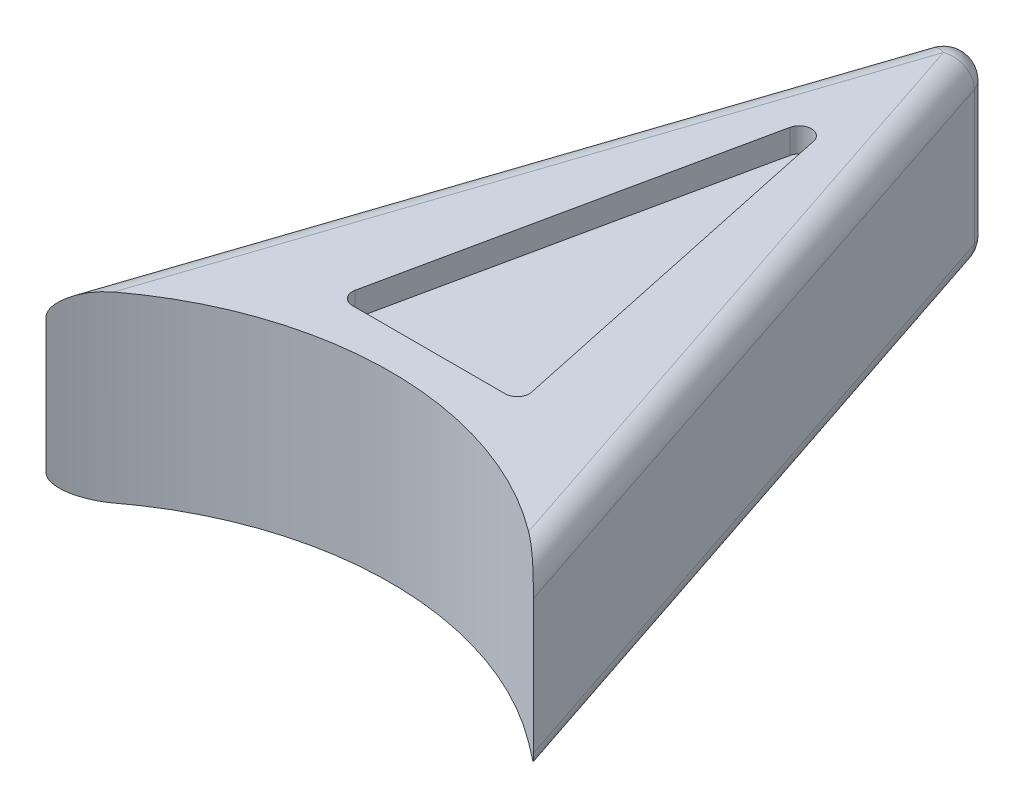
ISO-10303-21;
HEADER;
FILE_DESCRIPTION(('STEP AP214'),'2;1');
FILE_NAME('part.step','',(''),(''),'','','');
FILE_SCHEMA(('AUTOMOTIVE_DESIGN { 1 0 10303 214 1 1 1 1 }'));
ENDSEC;
DATA;
#1=APPLICATION_CONTEXT('core data for automotive mechanical design processes');
#2=APPLICATION_PROTOCOL_DEFINITION('international standard','automotive_design',2000,#1);
#3=PRODUCT_CONTEXT('',#1,'mechanical');
#4=PRODUCT('Part','Part','',(#3));
#5=PRODUCT_RELATED_PRODUCT_CATEGORY('part','',(#4));
#6=PRODUCT_DEFINITION_FORMATION('','',#4);
#7=PRODUCT_DEFINITION_CONTEXT('part definition',#1,'design');
#8=PRODUCT_DEFINITION('design','',#6,#7);
#9=PRODUCT_DEFINITION_SHAPE('','',#8);
#10=(LENGTH_UNIT() NAMED_UNIT(*) SI_UNIT(.MILLI.,.METRE.));
#11=(NAMED_UNIT(*) PLANE_ANGLE_UNIT() SI_UNIT($,.RADIAN.));
#12=(NAMED_UNIT(*) SI_UNIT($,.STERADIAN.) SOLID_ANGLE_UNIT());
#13=UNCERTAINTY_MEASURE_WITH_UNIT(LENGTH_MEASURE(1.E-05),#10,'distance_accuracy_value','');
#14=(GEOMETRIC_REPRESENTATION_CONTEXT(3) GLOBAL_UNCERTAINTY_ASSIGNED_CONTEXT((#13)) GLOBAL_UNIT_ASSIGNED_CONTEXT((#10,
#11,#12)) REPRESENTATION_CONTEXT('',''));
#15=CARTESIAN_POINT('',(0.,0.,0.));
#16=DIRECTION('',(0.,0.,1.));
#17=DIRECTION('',(1.,0.,0.));
#18=AXIS2_PLACEMENT_3D('',#15,#16,#17);
#19=CARTESIAN_POINT('',(25.4,19.05,0.));
#20=DIRECTION('',(-0.948683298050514,0.,0.316227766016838));
#21=DIRECTION('',(0.316227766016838,0.,0.948683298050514));
#22=AXIS2_PLACEMENT_3D('',#19,#20,#21);
#23=PLANE('',#22);
#24=DIRECTION('',(0.,-1.,0.));
#25=VECTOR('',#24,1.);
#26=CARTESIAN_POINT('',(25.4,19.05,0.));
#27=LINE('',#26,#25);
#28=CARTESIAN_POINT('',(25.4,16.51,0.));
#29=VERTEX_POINT('',#28);
#30=CARTESIAN_POINT('',(25.4,2.54000000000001,0.));
#31=VERTEX_POINT('',#30);
#32=EDGE_CURVE('E141',#29,#31,#27,.T.);
#33=ORIENTED_EDGE('',*,*,#32,.T.);
#34=DIRECTION('',(-0.316227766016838,0.,-0.948683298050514));
#35=VECTOR('',#34,1.);
#36=CARTESIAN_POINT('',(2.4096555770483,2.54,-68.9710332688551));
#37=LINE('',#36,#35);
#38=CARTESIAN_POINT('',(2.40965557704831,2.54,-68.9710332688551));
#39=VERTEX_POINT('',#38);
#40=EDGE_CURVE('E137',#31,#39,#37,.T.);
#41=ORIENTED_EDGE('',*,*,#40,.T.);
#42=DIRECTION('',(0.,-1.,0.));
#43=VECTOR('',#42,1.);
#44=CARTESIAN_POINT('',(2.40965557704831,19.05,-68.9710332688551));
#45=LINE('',#44,#43);
#46=CARTESIAN_POINT('',(2.40965557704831,16.51,-68.9710332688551));
#47=VERTEX_POINT('',#46);
#48=EDGE_CURVE('E139',#39,#47,#45,.F.);
#49=ORIENTED_EDGE('',*,*,#48,.T.);
#50=DIRECTION('',(-0.316227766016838,0.,-0.948683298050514));
#51=VECTOR('',#50,1.);
#52=CARTESIAN_POINT('',(25.4,16.51,0.));
#53=LINE('',#52,#51);
#54=EDGE_CURVE('E147',#47,#29,#53,.F.);
#55=ORIENTED_EDGE('',*,*,#54,.T.);
#56=EDGE_LOOP('',(#33,#41,#49,#55));
#57=FACE_BOUND('',#56,.T.);
#58=ADVANCED_FACE('F41',(#57),#23,.F.);
#59=CARTESIAN_POINT('',(0.,19.05,-76.2));
#60=DIRECTION('',(0.948683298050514,0.,0.316227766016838));
#61=DIRECTION('',(0.316227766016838,0.,-0.948683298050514));
#62=AXIS2_PLACEMENT_3D('',#59,#60,#61);
#63=PLANE('',#62);
#64=DIRECTION('',(0.,-1.,0.));
#65=VECTOR('',#64,1.);
#66=CARTESIAN_POINT('',(-2.4096555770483,19.05,-68.9710332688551));
#67=LINE('',#66,#65);
#68=CARTESIAN_POINT('',(-2.4096555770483,16.51,-68.9710332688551));
#69=VERTEX_POINT('',#68);
#70=CARTESIAN_POINT('',(-2.4096555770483,2.54,-68.9710332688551));
#71=VERTEX_POINT('',#70);
#72=EDGE_CURVE('E160',#69,#71,#67,.T.);
#73=ORIENTED_EDGE('',*,*,#72,.T.);
#74=DIRECTION('',(-0.316227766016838,0.,0.948683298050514));
#75=VECTOR('',#74,1.);
#76=CARTESIAN_POINT('',(-25.4,2.54,0.));
#77=LINE('',#76,#75);
#78=CARTESIAN_POINT('',(-25.4,2.54000000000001,0.));
#79=VERTEX_POINT('',#78);
#80=EDGE_CURVE('E245',#71,#79,#77,.T.);
#81=ORIENTED_EDGE('',*,*,#80,.T.);
#82=DIRECTION('',(0.,-1.,0.));
#83=VECTOR('',#82,1.);
#84=CARTESIAN_POINT('',(-25.4,19.05,0.));
#85=LINE('',#84,#83);
#86=CARTESIAN_POINT('',(-25.4,16.51,0.));
#87=VERTEX_POINT('',#86);
#88=EDGE_CURVE('E254',#87,#79,#85,.T.);
#89=ORIENTED_EDGE('',*,*,#88,.F.);
#90=DIRECTION('',(-0.316227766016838,0.,0.948683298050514));
#91=VECTOR('',#90,1.);
#92=CARTESIAN_POINT('',(0.,16.51,-76.2));
#93=LINE('',#92,#91);
#94=EDGE_CURVE('E170',#87,#69,#93,.F.);
#95=ORIENTED_EDGE('',*,*,#94,.T.);
#96=EDGE_LOOP('',(#73,#81,#89,#95));
#97=FACE_BOUND('',#96,.T.);
#98=ADVANCED_FACE('F290',(#97),#63,.F.);
#99=CARTESIAN_POINT('',(0.,19.05,25.4));
#100=DIRECTION('',(0.,-1.,0.));
#101=DIRECTION('',(0.,0.,-1.));
#102=AXIS2_PLACEMENT_3D('',#99,#100,#101);
#103=CYLINDRICAL_SURFACE('',#102,35.9210244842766);
#104=ORIENTED_EDGE('',*,*,#88,.T.);
#105=CARTESIAN_POINT('',(-25.4,2.54,0.));
#106=CARTESIAN_POINT('',(-25.4000079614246,2.50475902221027,8.4973830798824E-06));
#107=CARTESIAN_POINT('',(-25.3988395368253,2.46953826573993,-0.00116050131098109));
#108=CARTESIAN_POINT('',(-25.3942278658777,2.39943815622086,-0.00577115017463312));
#109=CARTESIAN_POINT('',(-25.3907874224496,2.3645584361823,-0.00921000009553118));
#110=CARTESIAN_POINT('',(-25.3772849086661,2.26162477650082,-0.0226980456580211));
#111=CARTESIAN_POINT('',(-25.3640373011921,2.19437447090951,-0.0359232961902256));
#112=CARTESIAN_POINT('',(-25.3258234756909,2.04661622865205,-0.0739779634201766));
#113=CARTESIAN_POINT('',(-25.2986982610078,1.96724235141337,-0.100937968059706));
#114=CARTESIAN_POINT('',(-25.235617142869,1.81534425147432,-0.16336430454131));
#115=CARTESIAN_POINT('',(-25.1996156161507,1.74285818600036,-0.198874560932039));
#116=CARTESIAN_POINT('',(-25.1281670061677,1.61712134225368,-0.268994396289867));
#117=CARTESIAN_POINT('',(-25.0937442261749,1.56273397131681,-0.302656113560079));
#118=CARTESIAN_POINT('',(-25.0214980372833,1.45831385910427,-0.372993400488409));
#119=CARTESIAN_POINT('',(-24.9836722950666,1.40828415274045,-0.409671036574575));
#120=CARTESIAN_POINT('',(-24.8661082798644,1.26401416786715,-0.523125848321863));
#121=CARTESIAN_POINT('',(-24.7823458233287,1.17569661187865,-0.603263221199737));
#122=CARTESIAN_POINT('',(-24.6095228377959,1.01368196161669,-0.766874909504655));
#123=CARTESIAN_POINT('',(-24.5206020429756,0.939727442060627,-0.850250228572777));
#124=CARTESIAN_POINT('',(-24.3376174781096,0.802165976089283,-1.01999170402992));
#125=CARTESIAN_POINT('',(-24.2435491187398,0.73856847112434,-1.10636050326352));
#126=CARTESIAN_POINT('',(-24.0511140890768,0.620249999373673,-1.28109578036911));
#127=CARTESIAN_POINT('',(-23.9527339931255,0.565559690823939,-1.36946801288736));
#128=CARTESIAN_POINT('',(-23.7526498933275,0.464387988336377,-1.54716207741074));
#129=CARTESIAN_POINT('',(-23.6509450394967,0.41790871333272,-1.63648414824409));
#130=CARTESIAN_POINT('',(-23.3961234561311,0.312458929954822,-1.8576910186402));
#131=CARTESIAN_POINT('',(-23.2413585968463,0.257919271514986,-1.98980329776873));
#132=CARTESIAN_POINT('',(-22.9268177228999,0.164334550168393,-2.25362951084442));
#133=CARTESIAN_POINT('',(-22.7670394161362,0.125296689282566,-2.38534323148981));
#134=CARTESIAN_POINT('',(-22.4459409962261,0.0630734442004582,-2.64535095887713));
#135=CARTESIAN_POINT('',(-22.2846852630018,0.0396470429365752,-2.77366610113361));
#136=CARTESIAN_POINT('',(-22.0405569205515,0.0159998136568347,-2.96449410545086));
#137=CARTESIAN_POINT('',(-21.9588333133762,0.0100328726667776,-3.02780923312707));
#138=CARTESIAN_POINT('',(-21.7947147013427,0.00203539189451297,-3.1538284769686));
#139=CARTESIAN_POINT('',(-21.712319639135,5.19196648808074E-06,-3.21653253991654));
#140=CARTESIAN_POINT('',(-21.6296425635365,0.,-3.2788870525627));
#141=B_SPLINE_CURVE_WITH_KNOTS('',3,(#105,#106,#107,#108,#109,#110,#111,#112,#113,#114,#115,
#116,#117,#118,#119,#120,#121,#122,#123,#124,#125,#126,#127,#128,#129,#130,#131,#132,#133,#134,
#135,#136,#137,#138,#139,#140),.UNSPECIFIED.,.F.,.F.,(4,2,2,2,2,2,2,2,2,2,2,2,2,2,2,2,2,4),(0.,
0.105647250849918,0.211164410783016,0.419533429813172,0.682411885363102,0.946670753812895,
1.16427414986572,1.38202790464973,1.81793863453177,2.2451176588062,2.67268394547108,
3.1016921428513,3.53081088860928,4.16208860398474,4.79365926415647,5.41523843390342,
5.72582840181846,6.03644518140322),.UNSPECIFIED.);
#142=CARTESIAN_POINT('',(-21.6296425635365,0.,-3.2788870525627));
#143=VERTEX_POINT('',#142);
#144=EDGE_CURVE('E233',#79,#143,#141,.T.);
#145=ORIENTED_EDGE('',*,*,#144,.T.);
#146=CARTESIAN_POINT('',(0.,0.,25.4));
#147=DIRECTION('',(0.,-1.,0.));
#148=DIRECTION('',(0.,0.,-1.));
#149=AXIS2_PLACEMENT_3D('',#146,#147,#148);
#150=CIRCLE('',#149,35.9210244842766);
#151=CARTESIAN_POINT('',(21.6296425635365,0.,-3.2788870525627));
#152=VERTEX_POINT('',#151);
#153=EDGE_CURVE('E180',#143,#152,#150,.T.);
#154=ORIENTED_EDGE('',*,*,#153,.T.);
#155=CARTESIAN_POINT('',(21.6296425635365,0.,-3.2788870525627));
#156=CARTESIAN_POINT('',(21.7154381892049,6.01707838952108E-06,-3.214180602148));
#157=CARTESIAN_POINT('',(21.8009292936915,0.00219177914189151,-3.14909828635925));
#158=CARTESIAN_POINT('',(21.9711862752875,0.0107984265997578,-3.01827745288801));
#159=CARTESIAN_POINT('',(22.0559521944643,0.0172190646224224,-2.95253897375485));
#160=CARTESIAN_POINT('',(22.3091464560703,0.0426615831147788,-2.75435879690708));
#161=CARTESIAN_POINT('',(22.4763249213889,0.0678636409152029,-2.62106278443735));
#162=CARTESIAN_POINT('',(22.8067337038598,0.134359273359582,-2.35280745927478));
#163=CARTESIAN_POINT('',(22.9699533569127,0.175692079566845,-2.21784487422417));
#164=CARTESIAN_POINT('',(23.2910202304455,0.27467017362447,-1.94761994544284));
#165=CARTESIAN_POINT('',(23.4488708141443,0.332305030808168,-1.81235784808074));
#166=CARTESIAN_POINT('',(23.6794982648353,0.431341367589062,-1.61132324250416));
#167=CARTESIAN_POINT('',(23.7547879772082,0.466133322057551,-1.54512837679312));
#168=CARTESIAN_POINT('',(23.9035690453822,0.54021657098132,-1.41322916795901));
#169=CARTESIAN_POINT('',(23.9770605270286,0.579507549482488,-1.34752479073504));
#170=CARTESIAN_POINT('',(24.1220596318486,0.662974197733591,-1.21683260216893));
#171=CARTESIAN_POINT('',(24.1935649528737,0.707155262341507,-1.15184567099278));
#172=CARTESIAN_POINT('',(24.3341390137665,0.800831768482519,-1.02307242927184));
#173=CARTESIAN_POINT('',(24.4032080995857,0.850326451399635,-0.959285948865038));
#174=CARTESIAN_POINT('',(24.5271153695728,0.946506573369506,-0.843980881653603));
#175=CARTESIAN_POINT('',(24.5824051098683,0.992282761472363,-0.792191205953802));
#176=CARTESIAN_POINT('',(24.690498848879,1.08842743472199,-0.690319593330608));
#177=CARTESIAN_POINT('',(24.7433035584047,1.13879459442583,-0.640237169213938));
#178=CARTESIAN_POINT('',(24.8456884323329,1.24456088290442,-0.542566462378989));
#179=CARTESIAN_POINT('',(24.8952776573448,1.29994471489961,-0.494971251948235));
#180=CARTESIAN_POINT('',(24.9904858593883,1.41651545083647,-0.403100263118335));
#181=CARTESIAN_POINT('',(25.0361086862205,1.47769660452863,-0.358821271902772));
#182=CARTESIAN_POINT('',(25.1205324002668,1.60423428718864,-0.276491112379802));
#183=CARTESIAN_POINT('',(25.1595248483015,1.66934847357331,-0.238268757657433));
#184=CARTESIAN_POINT('',(25.2309911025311,1.8062346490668,-0.167940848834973));
#185=CARTESIAN_POINT('',(25.2634682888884,1.87800315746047,-0.135832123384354));
#186=CARTESIAN_POINT('',(25.3155631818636,2.01731556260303,-0.0841796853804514));
#187=CARTESIAN_POINT('',(25.3363583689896,2.08398352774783,-0.0634932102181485));
#188=CARTESIAN_POINT('',(25.3697565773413,2.22122223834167,-0.030218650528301));
#189=CARTESIAN_POINT('',(25.3823832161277,2.29178108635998,-0.0176072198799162));
#190=CARTESIAN_POINT('',(25.3934951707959,2.39252069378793,-0.00650349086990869));
#191=CARTESIAN_POINT('',(25.3959272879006,2.42189414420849,-0.00407219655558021));
#192=CARTESIAN_POINT('',(25.399181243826,2.48083972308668,-0.0008188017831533));
#193=CARTESIAN_POINT('',(25.4000019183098,2.51041197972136,2.13512160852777E-06));
#194=CARTESIAN_POINT('',(25.4,2.54000000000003,-2.19338687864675E-13));
#195=B_SPLINE_CURVE_WITH_KNOTS('',3,(#155,#156,#157,#158,#159,#160,#161,#162,#163,#164,#165,
#166,#167,#168,#169,#170,#171,#172,#173,#174,#175,#176,#177,#178,#179,#180,#181,#182,#183,#184,
#185,#186,#187,#188,#189,#190,#191,#192,#193,#194),.UNSPECIFIED.,.F.,.F.,(4,2,2,2,2,2,2,2,2,2,2,
2,2,2,2,2,2,2,2,4),(0.,0.322328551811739,0.644638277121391,1.2898062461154,1.93655320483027,
2.5828872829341,2.90114953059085,3.21938944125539,3.53798400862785,3.85653315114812,
4.12193016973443,4.38725080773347,4.65178804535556,4.91606558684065,5.17044086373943,
5.42468382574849,5.642376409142,5.85943673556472,5.94808389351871,6.03679507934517),.UNSPECIFIED.);
#196=EDGE_CURVE('E236',#152,#31,#195,.T.);
#197=ORIENTED_EDGE('',*,*,#196,.T.);
#198=ORIENTED_EDGE('',*,*,#32,.F.);
#199=CARTESIAN_POINT('',(25.4,16.51,0.));
#200=CARTESIAN_POINT('',(25.4000079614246,16.5452409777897,8.49738307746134E-06));
#201=CARTESIAN_POINT('',(25.3988395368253,16.5804617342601,-0.00116050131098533));
#202=CARTESIAN_POINT('',(25.3942278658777,16.6505618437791,-0.00577115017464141));
#203=CARTESIAN_POINT('',(25.3907874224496,16.6854415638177,-0.00921000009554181));
#204=CARTESIAN_POINT('',(25.3772849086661,16.7883752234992,-0.0226980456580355));
#205=CARTESIAN_POINT('',(25.3640373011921,16.8556255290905,-0.0359232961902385));
#206=CARTESIAN_POINT('',(25.3258234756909,17.003383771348,-0.0739779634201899));
#207=CARTESIAN_POINT('',(25.2986982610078,17.0827576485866,-0.100937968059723));
#208=CARTESIAN_POINT('',(25.235617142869,17.2346557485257,-0.163364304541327));
#209=CARTESIAN_POINT('',(25.1996156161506,17.3071418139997,-0.198874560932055));
#210=CARTESIAN_POINT('',(25.1281670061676,17.4328786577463,-0.268994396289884));
#211=CARTESIAN_POINT('',(25.0937442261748,17.4872660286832,-0.302656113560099));
#212=CARTESIAN_POINT('',(25.0214980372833,17.5916861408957,-0.372993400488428));
#213=CARTESIAN_POINT('',(24.9836722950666,17.6417158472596,-0.409671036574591));
#214=CARTESIAN_POINT('',(24.8661082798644,17.7859858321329,-0.523125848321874));
#215=CARTESIAN_POINT('',(24.7823458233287,17.8743033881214,-0.603263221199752));
#216=CARTESIAN_POINT('',(24.6095228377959,18.0363180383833,-0.766874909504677));
#217=CARTESIAN_POINT('',(24.5206020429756,18.1102725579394,-0.850250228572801));
#218=CARTESIAN_POINT('',(24.3376174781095,18.2478340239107,-1.01999170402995));
#219=CARTESIAN_POINT('',(24.2435491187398,18.3114315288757,-1.10636050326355));
#220=CARTESIAN_POINT('',(24.0511140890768,18.4297500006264,-1.28109578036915));
#221=CARTESIAN_POINT('',(23.9527339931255,18.4844403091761,-1.36946801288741));
#222=CARTESIAN_POINT('',(23.7526498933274,18.5856120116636,-1.54716207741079));
#223=CARTESIAN_POINT('',(23.6509450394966,18.6320912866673,-1.63648414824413));
#224=CARTESIAN_POINT('',(23.3961234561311,18.7375410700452,-1.85769101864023));
#225=CARTESIAN_POINT('',(23.2413585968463,18.792080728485,-1.98980329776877));
#226=CARTESIAN_POINT('',(22.9268177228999,18.8856654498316,-2.25362951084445));
#227=CARTESIAN_POINT('',(22.7670394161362,18.9247033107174,-2.38534323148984));
#228=CARTESIAN_POINT('',(22.4459409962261,18.9869265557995,-2.64535095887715));
#229=CARTESIAN_POINT('',(22.2846852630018,19.0103529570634,-2.77366610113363));
#230=CARTESIAN_POINT('',(22.0405569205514,19.0340001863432,-2.96449410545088));
#231=CARTESIAN_POINT('',(21.9588333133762,19.0399671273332,-3.02780923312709));
#232=CARTESIAN_POINT('',(21.7947147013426,19.0479646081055,-3.15382847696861));
#233=CARTESIAN_POINT('',(21.7123196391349,19.0499948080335,-3.21653253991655));
#234=CARTESIAN_POINT('',(21.6296425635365,19.05,-3.2788870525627));
#235=B_SPLINE_CURVE_WITH_KNOTS('',3,(#199,#200,#201,#202,#203,#204,#205,#206,#207,#208,#209,
#210,#211,#212,#213,#214,#215,#216,#217,#218,#219,#220,#221,#222,#223,#224,#225,#226,#227,#228,
#229,#230,#231,#232,#233,#234),.UNSPECIFIED.,.F.,.F.,(4,2,2,2,2,2,2,2,2,2,2,2,2,2,2,2,2,4),(0.,
0.105647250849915,0.211164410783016,0.41953342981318,0.682411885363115,0.946670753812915,
1.16427414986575,1.38202790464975,1.8179386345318,2.24511765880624,2.67268394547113,
3.10169214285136,3.53081088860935,4.16208860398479,4.7936592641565,5.41523843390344,
5.72582840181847,6.03644518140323),.UNSPECIFIED.);
#236=CARTESIAN_POINT('',(21.6296425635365,19.05,-3.27888705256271));
#237=VERTEX_POINT('',#236);
#238=EDGE_CURVE('E242',#29,#237,#235,.T.);
#239=ORIENTED_EDGE('',*,*,#238,.T.);
#240=CARTESIAN_POINT('',(0.,19.05,25.4));
#241=DIRECTION('',(0.,-1.,0.));
#242=DIRECTION('',(0.,0.,-1.));
#243=AXIS2_PLACEMENT_3D('',#240,#241,#242);
#244=CIRCLE('',#243,35.9210244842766);
#245=CARTESIAN_POINT('',(-21.6296425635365,19.05,-3.27888705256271));
#246=VERTEX_POINT('',#245);
#247=EDGE_CURVE('E260',#246,#237,#244,.T.);
#248=ORIENTED_EDGE('',*,*,#247,.F.);
#249=CARTESIAN_POINT('',(-21.6296425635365,19.05,-3.2788870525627));
#250=CARTESIAN_POINT('',(-21.7154381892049,19.0499939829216,-3.21418060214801));
#251=CARTESIAN_POINT('',(-21.8009292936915,19.0478082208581,-3.14909828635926));
#252=CARTESIAN_POINT('',(-21.9711862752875,19.0392015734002,-3.01827745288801));
#253=CARTESIAN_POINT('',(-22.0559521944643,19.0327809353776,-2.95253897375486));
#254=CARTESIAN_POINT('',(-22.3091464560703,19.0073384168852,-2.75435879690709));
#255=CARTESIAN_POINT('',(-22.4763249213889,18.9821363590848,-2.62106278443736));
#256=CARTESIAN_POINT('',(-22.8067337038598,18.9156407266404,-2.35280745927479));
#257=CARTESIAN_POINT('',(-22.9699533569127,18.8743079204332,-2.21784487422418));
#258=CARTESIAN_POINT('',(-23.2910202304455,18.7753298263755,-1.94761994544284));
#259=CARTESIAN_POINT('',(-23.4488708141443,18.7176949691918,-1.81235784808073));
#260=CARTESIAN_POINT('',(-23.6794982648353,18.6186586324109,-1.61132324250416));
#261=CARTESIAN_POINT('',(-23.7547879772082,18.5838666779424,-1.54512837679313));
#262=CARTESIAN_POINT('',(-23.9035690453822,18.5097834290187,-1.41322916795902));
#263=CARTESIAN_POINT('',(-23.9770605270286,18.4704924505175,-1.34752479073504));
#264=CARTESIAN_POINT('',(-24.1220596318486,18.3870258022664,-1.21683260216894));
#265=CARTESIAN_POINT('',(-24.1935649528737,18.3428447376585,-1.15184567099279));
#266=CARTESIAN_POINT('',(-24.3341390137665,18.2491682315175,-1.02307242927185));
#267=CARTESIAN_POINT('',(-24.4032080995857,18.1996735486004,-0.959285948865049));
#268=CARTESIAN_POINT('',(-24.5271153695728,18.1034934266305,-0.843980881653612));
#269=CARTESIAN_POINT('',(-24.5824051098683,18.0577172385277,-0.792191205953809));
#270=CARTESIAN_POINT('',(-24.690498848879,17.961572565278,-0.690319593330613));
#271=CARTESIAN_POINT('',(-24.7433035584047,17.9112054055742,-0.640237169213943));
#272=CARTESIAN_POINT('',(-24.8456884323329,17.8054391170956,-0.542566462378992));
#273=CARTESIAN_POINT('',(-24.8952776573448,17.7500552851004,-0.494971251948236));
#274=CARTESIAN_POINT('',(-24.9904858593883,17.6334845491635,-0.403100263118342));
#275=CARTESIAN_POINT('',(-25.0361086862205,17.5723033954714,-0.358821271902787));
#276=CARTESIAN_POINT('',(-25.1205324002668,17.4457657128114,-0.27649111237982));
#277=CARTESIAN_POINT('',(-25.1595248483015,17.3806515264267,-0.238268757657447));
#278=CARTESIAN_POINT('',(-25.2309911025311,17.2437653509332,-0.16794084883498));
#279=CARTESIAN_POINT('',(-25.2634682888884,17.1719968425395,-0.135832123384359));
#280=CARTESIAN_POINT('',(-25.3155631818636,17.032684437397,-0.0841796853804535));
#281=CARTESIAN_POINT('',(-25.3363583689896,16.9660164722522,-0.0634932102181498));
#282=CARTESIAN_POINT('',(-25.3697565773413,16.8287777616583,-0.0302186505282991));
#283=CARTESIAN_POINT('',(-25.3823832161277,16.75821891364,-0.0176072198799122));
#284=CARTESIAN_POINT('',(-25.3934951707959,16.6574793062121,-0.00650349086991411));
#285=CARTESIAN_POINT('',(-25.3959272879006,16.6281058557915,-0.00407219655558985));
#286=CARTESIAN_POINT('',(-25.399181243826,16.5691602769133,-0.000818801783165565));
#287=CARTESIAN_POINT('',(-25.4000019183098,16.5395880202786,2.13512159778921E-06));
#288=CARTESIAN_POINT('',(-25.4,16.51,-2.21374963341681E-13));
#289=B_SPLINE_CURVE_WITH_KNOTS('',3,(#249,#250,#251,#252,#253,#254,#255,#256,#257,#258,#259,
#260,#261,#262,#263,#264,#265,#266,#267,#268,#269,#270,#271,#272,#273,#274,#275,#276,#277,#278,
#279,#280,#281,#282,#283,#284,#285,#286,#287,#288),.UNSPECIFIED.,.F.,.F.,(4,2,2,2,2,2,2,2,2,2,2,
2,2,2,2,2,2,2,2,4),(0.,0.32232855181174,0.644638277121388,1.2898062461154,1.93655320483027,
2.5828872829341,2.90114953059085,3.21938944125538,3.53798400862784,3.85653315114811,
4.12193016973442,4.38725080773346,4.65178804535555,4.91606558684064,5.17044086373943,
5.42468382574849,5.64237640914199,5.85943673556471,5.94808389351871,6.03679507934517),.UNSPECIFIED.);
#290=EDGE_CURVE('E239',#246,#87,#289,.T.);
#291=ORIENTED_EDGE('',*,*,#290,.T.);
#292=EDGE_LOOP('',(#104,#145,#154,#197,#198,#239,#248,#291));
#293=FACE_BOUND('',#292,.T.);
#294=ADVANCED_FACE('F284',(#293),#103,.F.);
#295=CARTESIAN_POINT('',(0.,19.05,25.4));
#296=DIRECTION('',(0.,-1.,0.));
#297=DIRECTION('',(0.,0.,-1.));
#298=AXIS2_PLACEMENT_3D('',#295,#296,#297);
#299=PLANE('',#298);
#300=DIRECTION('',(-0.208333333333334,0.,0.978057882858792));
#301=VECTOR('',#300,1.);
#302=CARTESIAN_POINT('',(0.,19.05,-59.2149399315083));
#303=LINE('',#302,#301);
#304=CARTESIAN_POINT('',(-1.24213351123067,19.05,-53.3835232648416));
#305=VERTEX_POINT('',#304);
#306=CARTESIAN_POINT('',(-9.19812276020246,19.05,-16.0327168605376));
#307=VERTEX_POINT('',#306);
#308=EDGE_CURVE('E394',#305,#307,#303,.T.);
#309=ORIENTED_EDGE('',*,*,#308,.F.);
#310=CARTESIAN_POINT('',(0.,19.05,-53.1189399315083));
#311=DIRECTION('',(0.,-1.,0.));
#312=DIRECTION('',(0.,0.,-1.));
#313=AXIS2_PLACEMENT_3D('',#310,#311,#312);
#314=CIRCLE('',#313,1.27);
#315=CARTESIAN_POINT('',(1.24213351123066,19.05,-53.3835232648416));
#316=VERTEX_POINT('',#315);
#317=EDGE_CURVE('E221',#305,#316,#314,.T.);
#318=ORIENTED_EDGE('',*,*,#317,.T.);
#319=DIRECTION('',(-0.208333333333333,0.,-0.978057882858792));
#320=VECTOR('',#319,1.);
#321=CARTESIAN_POINT('',(9.52499999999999,19.05,-14.4981335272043));
#322=LINE('',#321,#320);
#323=CARTESIAN_POINT('',(9.19812276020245,19.05,-16.0327168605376));
#324=VERTEX_POINT('',#323);
#325=EDGE_CURVE('E397',#324,#316,#322,.T.);
#326=ORIENTED_EDGE('',*,*,#325,.F.);
#327=CARTESIAN_POINT('',(7.95598924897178,19.05,-15.7681335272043));
#328=DIRECTION('',(0.,-1.,0.));
#329=DIRECTION('',(0.,0.,-1.));
#330=AXIS2_PLACEMENT_3D('',#327,#328,#329);
#331=CIRCLE('',#330,1.27);
#332=CARTESIAN_POINT('',(7.95598924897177,19.05,-14.4981335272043));
#333=VERTEX_POINT('',#332);
#334=EDGE_CURVE('E50',#324,#333,#331,.T.);
#335=ORIENTED_EDGE('',*,*,#334,.T.);
#336=DIRECTION('',(1.,0.,0.));
#337=VECTOR('',#336,1.);
#338=CARTESIAN_POINT('',(-9.52500000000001,19.05,-14.4981335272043));
#339=LINE('',#338,#337);
#340=CARTESIAN_POINT('',(-7.9559892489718,19.05,-14.4981335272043));
#341=VERTEX_POINT('',#340);
#342=EDGE_CURVE('E389',#341,#333,#339,.T.);
#343=ORIENTED_EDGE('',*,*,#342,.F.);
#344=CARTESIAN_POINT('',(-7.9559892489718,19.05,-15.7681335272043));
#345=DIRECTION('',(0.,-1.,0.));
#346=DIRECTION('',(0.,0.,-1.));
#347=AXIS2_PLACEMENT_3D('',#344,#345,#346);
#348=CIRCLE('',#347,1.27);
#349=EDGE_CURVE('E11',#341,#307,#348,.T.);
#350=ORIENTED_EDGE('',*,*,#349,.T.);
#351=EDGE_LOOP('',(#309,#318,#326,#335,#343,#350));
#352=FACE_BOUND('',#351,.T.);
#353=DIRECTION('',(-0.316227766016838,0.,-0.948683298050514));
#354=VECTOR('',#353,1.);
#355=CARTESIAN_POINT('',(28.0703444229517,19.05,16.0432185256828));
#356=LINE('',#355,#354);
#357=CARTESIAN_POINT('',(0.,19.05,-68.1678147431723));
#358=VERTEX_POINT('',#357);
#359=EDGE_CURVE('E146',#237,#358,#356,.T.);
#360=ORIENTED_EDGE('',*,*,#359,.T.);
#361=DIRECTION('',(-0.316227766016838,0.,0.948683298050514));
#362=VECTOR('',#361,1.);
#363=CARTESIAN_POINT('',(-28.0703444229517,19.05,16.0432185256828));
#364=LINE('',#363,#362);
#365=EDGE_CURVE('E185',#358,#246,#364,.T.);
#366=ORIENTED_EDGE('',*,*,#365,.T.);
#367=ORIENTED_EDGE('',*,*,#247,.T.);
#368=EDGE_LOOP('',(#360,#366,#367));
#369=FACE_BOUND('',#368,.T.);
#370=ADVANCED_FACE('F289',(#352,#369),#299,.F.);
#371=CARTESIAN_POINT('',(0.,0.,25.4));
#372=DIRECTION('',(0.,-1.,0.));
#373=DIRECTION('',(0.,0.,-1.));
#374=AXIS2_PLACEMENT_3D('',#371,#372,#373);
#375=PLANE('',#374);
#376=ORIENTED_EDGE('',*,*,#153,.F.);
#377=DIRECTION('',(-0.316227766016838,0.,0.948683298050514));
#378=VECTOR('',#377,1.);
#379=CARTESIAN_POINT('',(0.,0.,-68.1678147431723));
#380=LINE('',#379,#378);
#381=CARTESIAN_POINT('',(0.,0.,-68.1678147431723));
#382=VERTEX_POINT('',#381);
#383=EDGE_CURVE('E228',#143,#382,#380,.F.);
#384=ORIENTED_EDGE('',*,*,#383,.T.);
#385=DIRECTION('',(-0.316227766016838,0.,-0.948683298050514));
#386=VECTOR('',#385,1.);
#387=CARTESIAN_POINT('',(22.9903444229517,0.,0.803218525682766));
#388=LINE('',#387,#386);
#389=EDGE_CURVE('E174',#382,#152,#388,.F.);
#390=ORIENTED_EDGE('',*,*,#389,.T.);
#391=EDGE_LOOP('',(#376,#384,#390));
#392=FACE_BOUND('',#391,.T.);
#393=ADVANCED_FACE('F291',(#392),#375,.T.);
#394=CARTESIAN_POINT('',(0.,19.05,-68.1678147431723));
#395=DIRECTION('',(0.,-1.,0.));
#396=DIRECTION('',(0.,0.,-1.));
#397=AXIS2_PLACEMENT_3D('',#394,#395,#396);
#398=CYLINDRICAL_SURFACE('',#397,2.54);
#399=ORIENTED_EDGE('',*,*,#48,.F.);
#400=CARTESIAN_POINT('',(0.,2.54,-68.1678147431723));
#401=DIRECTION('',(0.,-1.,0.));
#402=DIRECTION('',(0.,0.,-1.));
#403=AXIS2_PLACEMENT_3D('',#400,#401,#402);
#404=CIRCLE('',#403,2.54);
#405=EDGE_CURVE('E155',#39,#71,#404,.F.);
#406=ORIENTED_EDGE('',*,*,#405,.T.);
#407=ORIENTED_EDGE('',*,*,#72,.F.);
#408=CARTESIAN_POINT('',(0.,16.51,-68.1678147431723));
#409=DIRECTION('',(0.,-1.,0.));
#410=DIRECTION('',(0.,0.,-1.));
#411=AXIS2_PLACEMENT_3D('',#408,#409,#410);
#412=CIRCLE('',#411,2.54);
#413=EDGE_CURVE('E158',#69,#47,#412,.T.);
#414=ORIENTED_EDGE('',*,*,#413,.T.);
#415=EDGE_LOOP('',(#399,#406,#407,#414));
#416=FACE_BOUND('',#415,.T.);
#417=ADVANCED_FACE('F153',(#416),#398,.T.);
#418=CARTESIAN_POINT('',(2.40965557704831,2.54,-75.3967814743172));
#419=DIRECTION('',(0.316227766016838,0.,-0.948683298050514));
#420=DIRECTION('',(-0.948683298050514,0.,-0.316227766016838));
#421=AXIS2_PLACEMENT_3D('',#418,#419,#420);
#422=CYLINDRICAL_SURFACE('',#421,2.54);
#423=ORIENTED_EDGE('',*,*,#144,.F.);
#424=ORIENTED_EDGE('',*,*,#80,.F.);
#425=CARTESIAN_POINT('',(0.,2.54,-68.1678147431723));
#426=DIRECTION('',(0.316227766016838,0.,-0.948683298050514));
#427=DIRECTION('',(-0.948683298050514,0.,-0.316227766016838));
#428=AXIS2_PLACEMENT_3D('',#425,#426,#427);
#429=CIRCLE('',#428,2.54);
#430=EDGE_CURVE('E167',#382,#71,#429,.T.);
#431=ORIENTED_EDGE('',*,*,#430,.F.);
#432=ORIENTED_EDGE('',*,*,#383,.F.);
#433=EDGE_LOOP('',(#423,#424,#431,#432));
#434=FACE_BOUND('',#433,.T.);
#435=ADVANCED_FACE('F310',(#434),#422,.T.);
#436=CARTESIAN_POINT('',(22.9903444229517,2.54,0.803218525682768));
#437=DIRECTION('',(0.316227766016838,0.,0.948683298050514));
#438=DIRECTION('',(0.948683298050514,0.,-0.316227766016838));
#439=AXIS2_PLACEMENT_3D('',#436,#437,#438);
#440=CYLINDRICAL_SURFACE('',#439,2.54);
#441=ORIENTED_EDGE('',*,*,#196,.F.);
#442=ORIENTED_EDGE('',*,*,#389,.F.);
#443=CARTESIAN_POINT('',(0.,2.54,-68.1678147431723));
#444=DIRECTION('',(-0.316227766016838,0.,-0.948683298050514));
#445=DIRECTION('',(-0.948683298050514,0.,0.316227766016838));
#446=AXIS2_PLACEMENT_3D('',#443,#444,#445);
#447=CIRCLE('',#446,2.54);
#448=EDGE_CURVE('E165',#39,#382,#447,.T.);
#449=ORIENTED_EDGE('',*,*,#448,.F.);
#450=ORIENTED_EDGE('',*,*,#40,.F.);
#451=EDGE_LOOP('',(#441,#442,#449,#450));
#452=FACE_BOUND('',#451,.T.);
#453=ADVANCED_FACE('F173',(#452),#440,.T.);
#454=CARTESIAN_POINT('',(0.,2.54,-68.1678147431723));
#455=DIRECTION('',(0.,-1.,0.));
#456=DIRECTION('',(0.,0.,-1.));
#457=AXIS2_PLACEMENT_3D('',#454,#455,#456);
#458=SPHERICAL_SURFACE('',#457,2.54);
#459=ORIENTED_EDGE('',*,*,#430,.T.);
#460=ORIENTED_EDGE('',*,*,#405,.F.);
#461=ORIENTED_EDGE('',*,*,#448,.T.);
#462=EDGE_LOOP('',(#459,#460,#461));
#463=FACE_BOUND('',#462,.T.);
#464=ADVANCED_FACE('F164',(#463),#458,.T.);
#465=CARTESIAN_POINT('',(28.0703444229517,16.51,16.0432185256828));
#466=DIRECTION('',(-0.316227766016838,0.,-0.948683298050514));
#467=DIRECTION('',(-0.948683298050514,0.,0.316227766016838));
#468=AXIS2_PLACEMENT_3D('',#465,#466,#467);
#469=CYLINDRICAL_SURFACE('',#468,2.54);
#470=ORIENTED_EDGE('',*,*,#238,.F.);
#471=ORIENTED_EDGE('',*,*,#54,.F.);
#472=CARTESIAN_POINT('',(0.,16.51,-68.1678147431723));
#473=DIRECTION('',(-0.316227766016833,0.,-0.948683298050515));
#474=DIRECTION('',(-0.948683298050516,0.,0.316227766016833));
#475=AXIS2_PLACEMENT_3D('',#472,#473,#474);
#476=CIRCLE('',#475,2.54);
#477=EDGE_CURVE('E176',#358,#47,#476,.T.);
#478=ORIENTED_EDGE('',*,*,#477,.F.);
#479=ORIENTED_EDGE('',*,*,#359,.F.);
#480=EDGE_LOOP('',(#470,#471,#478,#479));
#481=FACE_BOUND('',#480,.T.);
#482=ADVANCED_FACE('F281',(#481),#469,.T.);
#483=CARTESIAN_POINT('',(-28.0703444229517,16.51,16.0432185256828));
#484=DIRECTION('',(-0.316227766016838,0.,0.948683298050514));
#485=DIRECTION('',(0.948683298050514,0.,0.316227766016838));
#486=AXIS2_PLACEMENT_3D('',#483,#484,#485);
#487=CYLINDRICAL_SURFACE('',#486,2.54);
#488=ORIENTED_EDGE('',*,*,#290,.F.);
#489=ORIENTED_EDGE('',*,*,#365,.F.);
#490=CARTESIAN_POINT('',(0.,16.51,-68.1678147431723));
#491=DIRECTION('',(0.316227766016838,0.,-0.948683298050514));
#492=DIRECTION('',(-0.948683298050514,0.,-0.316227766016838));
#493=AXIS2_PLACEMENT_3D('',#490,#491,#492);
#494=CIRCLE('',#493,2.54);
#495=EDGE_CURVE('E182',#69,#358,#494,.T.);
#496=ORIENTED_EDGE('',*,*,#495,.F.);
#497=ORIENTED_EDGE('',*,*,#94,.F.);
#498=EDGE_LOOP('',(#488,#489,#496,#497));
#499=FACE_BOUND('',#498,.T.);
#500=ADVANCED_FACE('F319',(#499),#487,.T.);
#501=CARTESIAN_POINT('',(0.,16.51,-68.1678147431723));
#502=DIRECTION('',(0.,-1.,0.));
#503=DIRECTION('',(0.,0.,-1.));
#504=AXIS2_PLACEMENT_3D('',#501,#502,#503);
#505=SPHERICAL_SURFACE('',#504,2.54);
#506=ORIENTED_EDGE('',*,*,#477,.T.);
#507=ORIENTED_EDGE('',*,*,#413,.F.);
#508=ORIENTED_EDGE('',*,*,#495,.T.);
#509=EDGE_LOOP('',(#506,#507,#508));
#510=FACE_BOUND('',#509,.T.);
#511=ADVANCED_FACE('F316',(#510),#505,.T.);
#512=CARTESIAN_POINT('',(9.52499999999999,16.51,-14.4981335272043));
#513=DIRECTION('',(0.978057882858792,0.,-0.208333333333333));
#514=DIRECTION('',(-0.208333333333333,0.,-0.978057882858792));
#515=AXIS2_PLACEMENT_3D('',#512,#513,#514);
#516=PLANE('',#515);
#517=ORIENTED_EDGE('',*,*,#325,.T.);
#518=DIRECTION('',(0.,1.,0.));
#519=VECTOR('',#518,1.);
#520=CARTESIAN_POINT('',(1.24213351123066,16.51,-53.3835232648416));
#521=LINE('',#520,#519);
#522=CARTESIAN_POINT('',(1.24213351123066,16.51,-53.3835232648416));
#523=VERTEX_POINT('',#522);
#524=EDGE_CURVE('E203',#316,#523,#521,.F.);
#525=ORIENTED_EDGE('',*,*,#524,.T.);
#526=DIRECTION('',(-0.208333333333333,0.,-0.978057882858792));
#527=VECTOR('',#526,1.);
#528=CARTESIAN_POINT('',(9.52499999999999,16.51,-14.4981335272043));
#529=LINE('',#528,#527);
#530=CARTESIAN_POINT('',(9.19812276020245,16.51,-16.0327168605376));
#531=VERTEX_POINT('',#530);
#532=EDGE_CURVE('E380',#531,#523,#529,.T.);
#533=ORIENTED_EDGE('',*,*,#532,.F.);
#534=DIRECTION('',(0.,1.,0.));
#535=VECTOR('',#534,1.);
#536=CARTESIAN_POINT('',(9.19812276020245,19.05,-16.0327168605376));
#537=LINE('',#536,#535);
#538=EDGE_CURVE('E199',#531,#324,#537,.T.);
#539=ORIENTED_EDGE('',*,*,#538,.T.);
#540=EDGE_LOOP('',(#517,#525,#533,#539));
#541=FACE_BOUND('',#540,.T.);
#542=ADVANCED_FACE('F318',(#541),#516,.F.);
#543=CARTESIAN_POINT('',(-9.52500000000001,16.51,-14.4981335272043));
#544=DIRECTION('',(0.,0.,1.));
#545=DIRECTION('',(1.,0.,0.));
#546=AXIS2_PLACEMENT_3D('',#543,#544,#545);
#547=PLANE('',#546);
#548=ORIENTED_EDGE('',*,*,#342,.T.);
#549=DIRECTION('',(0.,1.,0.));
#550=VECTOR('',#549,1.);
#551=CARTESIAN_POINT('',(7.95598924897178,16.51,-14.4981335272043));
#552=LINE('',#551,#550);
#553=CARTESIAN_POINT('',(7.95598924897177,16.51,-14.4981335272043));
#554=VERTEX_POINT('',#553);
#555=EDGE_CURVE('E218',#333,#554,#552,.F.);
#556=ORIENTED_EDGE('',*,*,#555,.T.);
#557=DIRECTION('',(1.,0.,0.));
#558=VECTOR('',#557,1.);
#559=CARTESIAN_POINT('',(-9.52500000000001,16.51,-14.4981335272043));
#560=LINE('',#559,#558);
#561=CARTESIAN_POINT('',(-7.9559892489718,16.51,-14.4981335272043));
#562=VERTEX_POINT('',#561);
#563=EDGE_CURVE('E190',#562,#554,#560,.T.);
#564=ORIENTED_EDGE('',*,*,#563,.F.);
#565=DIRECTION('',(0.,1.,0.));
#566=VECTOR('',#565,1.);
#567=CARTESIAN_POINT('',(-7.9559892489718,19.05,-14.4981335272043));
#568=LINE('',#567,#566);
#569=EDGE_CURVE('E215',#562,#341,#568,.T.);
#570=ORIENTED_EDGE('',*,*,#569,.T.);
#571=EDGE_LOOP('',(#548,#556,#564,#570));
#572=FACE_BOUND('',#571,.T.);
#573=ADVANCED_FACE('F360',(#572),#547,.F.);
#574=CARTESIAN_POINT('',(0.,16.51,-59.2149399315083));
#575=DIRECTION('',(-0.978057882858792,0.,-0.208333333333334));
#576=DIRECTION('',(-0.208333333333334,0.,0.978057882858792));
#577=AXIS2_PLACEMENT_3D('',#574,#575,#576);
#578=PLANE('',#577);
#579=DIRECTION('',(-0.208333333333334,0.,0.978057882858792));
#580=VECTOR('',#579,1.);
#581=CARTESIAN_POINT('',(0.,16.51,-59.2149399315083));
#582=LINE('',#581,#580);
#583=CARTESIAN_POINT('',(-1.24213351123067,16.51,-53.3835232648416));
#584=VERTEX_POINT('',#583);
#585=CARTESIAN_POINT('',(-9.19812276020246,16.51,-16.0327168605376));
#586=VERTEX_POINT('',#585);
#587=EDGE_CURVE('E388',#584,#586,#582,.T.);
#588=ORIENTED_EDGE('',*,*,#587,.F.);
#589=DIRECTION('',(0.,1.,0.));
#590=VECTOR('',#589,1.);
#591=CARTESIAN_POINT('',(-1.24213351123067,19.05,-53.3835232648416));
#592=LINE('',#591,#590);
#593=EDGE_CURVE('E195',#584,#305,#592,.T.);
#594=ORIENTED_EDGE('',*,*,#593,.T.);
#595=ORIENTED_EDGE('',*,*,#308,.T.);
#596=DIRECTION('',(0.,1.,0.));
#597=VECTOR('',#596,1.);
#598=CARTESIAN_POINT('',(-9.19812276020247,16.51,-16.0327168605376));
#599=LINE('',#598,#597);
#600=EDGE_CURVE('E192',#307,#586,#599,.F.);
#601=ORIENTED_EDGE('',*,*,#600,.T.);
#602=EDGE_LOOP('',(#588,#594,#595,#601));
#603=FACE_BOUND('',#602,.T.);
#604=ADVANCED_FACE('F362',(#603),#578,.F.);
#605=CARTESIAN_POINT('',(0.,16.51,0.));
#606=DIRECTION('',(0.,-1.,0.));
#607=DIRECTION('',(0.,0.,-1.));
#608=AXIS2_PLACEMENT_3D('',#605,#606,#607);
#609=PLANE('',#608);
#610=ORIENTED_EDGE('',*,*,#532,.T.);
#611=CARTESIAN_POINT('',(0.,16.51,-53.1189399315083));
#612=DIRECTION('',(0.,-1.,0.));
#613=DIRECTION('',(0.,0.,-1.));
#614=AXIS2_PLACEMENT_3D('',#611,#612,#613);
#615=CIRCLE('',#614,1.27);
#616=EDGE_CURVE('E212',#523,#584,#615,.F.);
#617=ORIENTED_EDGE('',*,*,#616,.T.);
#618=ORIENTED_EDGE('',*,*,#587,.T.);
#619=CARTESIAN_POINT('',(-7.9559892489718,16.51,-15.7681335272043));
#620=DIRECTION('',(0.,-1.,0.));
#621=DIRECTION('',(0.,0.,-1.));
#622=AXIS2_PLACEMENT_3D('',#619,#620,#621);
#623=CIRCLE('',#622,1.27);
#624=EDGE_CURVE('E206',#586,#562,#623,.F.);
#625=ORIENTED_EDGE('',*,*,#624,.T.);
#626=ORIENTED_EDGE('',*,*,#563,.T.);
#627=CARTESIAN_POINT('',(7.95598924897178,16.51,-15.7681335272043));
#628=DIRECTION('',(0.,-1.,0.));
#629=DIRECTION('',(0.,0.,-1.));
#630=AXIS2_PLACEMENT_3D('',#627,#628,#629);
#631=CIRCLE('',#630,1.27);
#632=EDGE_CURVE('E209',#554,#531,#631,.F.);
#633=ORIENTED_EDGE('',*,*,#632,.T.);
#634=EDGE_LOOP('',(#610,#617,#618,#625,#626,#633));
#635=FACE_BOUND('',#634,.T.);
#636=ADVANCED_FACE('F365',(#635),#609,.F.);
#637=CARTESIAN_POINT('',(0.,16.51,-53.1189399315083));
#638=DIRECTION('',(0.,-1.,0.));
#639=DIRECTION('',(0.,0.,-1.));
#640=AXIS2_PLACEMENT_3D('',#637,#638,#639);
#641=CYLINDRICAL_SURFACE('',#640,1.27);
#642=ORIENTED_EDGE('',*,*,#616,.F.);
#643=ORIENTED_EDGE('',*,*,#524,.F.);
#644=ORIENTED_EDGE('',*,*,#317,.F.);
#645=ORIENTED_EDGE('',*,*,#593,.F.);
#646=EDGE_LOOP('',(#642,#643,#644,#645));
#647=FACE_BOUND('',#646,.T.);
#648=ADVANCED_FACE('F371',(#647),#641,.F.);
#649=CARTESIAN_POINT('',(7.95598924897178,16.51,-15.7681335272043));
#650=DIRECTION('',(0.,-1.,0.));
#651=DIRECTION('',(0.,0.,-1.));
#652=AXIS2_PLACEMENT_3D('',#649,#650,#651);
#653=CYLINDRICAL_SURFACE('',#652,1.27);
#654=ORIENTED_EDGE('',*,*,#632,.F.);
#655=ORIENTED_EDGE('',*,*,#555,.F.);
#656=ORIENTED_EDGE('',*,*,#334,.F.);
#657=ORIENTED_EDGE('',*,*,#538,.F.);
#658=EDGE_LOOP('',(#654,#655,#656,#657));
#659=FACE_BOUND('',#658,.T.);
#660=ADVANCED_FACE('F376',(#659),#653,.F.);
#661=CARTESIAN_POINT('',(-7.9559892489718,16.51,-15.7681335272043));
#662=DIRECTION('',(0.,-1.,0.));
#663=DIRECTION('',(0.,0.,-1.));
#664=AXIS2_PLACEMENT_3D('',#661,#662,#663);
#665=CYLINDRICAL_SURFACE('',#664,1.27);
#666=ORIENTED_EDGE('',*,*,#624,.F.);
#667=ORIENTED_EDGE('',*,*,#600,.F.);
#668=ORIENTED_EDGE('',*,*,#349,.F.);
#669=ORIENTED_EDGE('',*,*,#569,.F.);
#670=EDGE_LOOP('',(#666,#667,#668,#669));
#671=FACE_BOUND('',#670,.T.);
#672=ADVANCED_FACE('F43',(#671),#665,.F.);
#673=CLOSED_SHELL('',(#58,#98,#294,#370,#393,#417,#435,#453,#464,#482,#500,#511,#542,#573,#604,
#636,#648,#660,#672));
#674=MANIFOLD_SOLID_BREP('B2',#673);
#675=ADVANCED_BREP_SHAPE_REPRESENTATION('',(#18,#674),#14);
#676=SHAPE_DEFINITION_REPRESENTATION(#9,#675);
ENDSEC;
END-ISO-10303-21;
